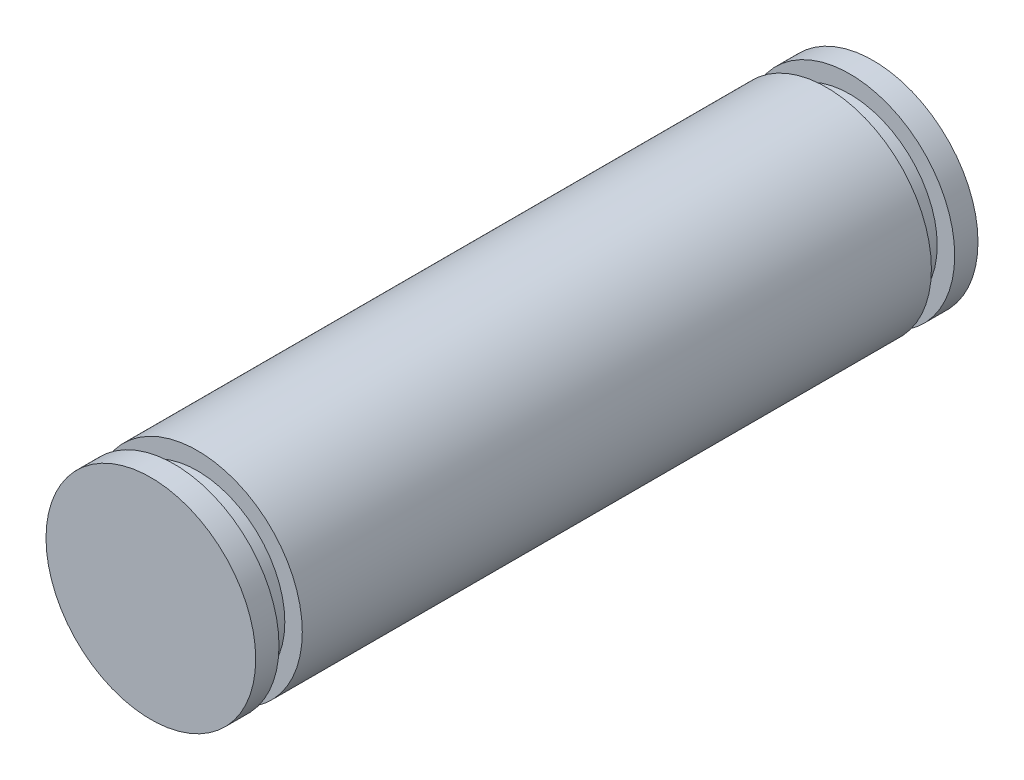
ISO-10303-21;
HEADER;
FILE_DESCRIPTION(('STEP AP214'),'2;1');
FILE_NAME('part.step','',(''),(''),'','','');
FILE_SCHEMA(('AUTOMOTIVE_DESIGN { 1 0 10303 214 1 1 1 1 }'));
ENDSEC;
DATA;
#1=APPLICATION_CONTEXT('core data for automotive mechanical design processes');
#2=APPLICATION_PROTOCOL_DEFINITION('international standard','automotive_design',2000,#1);
#3=PRODUCT_CONTEXT('',#1,'mechanical');
#4=PRODUCT('Part','Part','',(#3));
#5=PRODUCT_RELATED_PRODUCT_CATEGORY('part','',(#4));
#6=PRODUCT_DEFINITION_FORMATION('','',#4);
#7=PRODUCT_DEFINITION_CONTEXT('part definition',#1,'design');
#8=PRODUCT_DEFINITION('design','',#6,#7);
#9=PRODUCT_DEFINITION_SHAPE('','',#8);
#10=(LENGTH_UNIT() NAMED_UNIT(*) SI_UNIT(.MILLI.,.METRE.));
#11=(NAMED_UNIT(*) PLANE_ANGLE_UNIT() SI_UNIT($,.RADIAN.));
#12=(NAMED_UNIT(*) SI_UNIT($,.STERADIAN.) SOLID_ANGLE_UNIT());
#13=UNCERTAINTY_MEASURE_WITH_UNIT(LENGTH_MEASURE(1.E-05),#10,'distance_accuracy_value','');
#14=(GEOMETRIC_REPRESENTATION_CONTEXT(3) GLOBAL_UNCERTAINTY_ASSIGNED_CONTEXT((#13)) GLOBAL_UNIT_ASSIGNED_CONTEXT((#10,
#11,#12)) REPRESENTATION_CONTEXT('',''));
#15=CARTESIAN_POINT('',(0.,0.,0.));
#16=DIRECTION('',(0.,0.,1.));
#17=DIRECTION('',(1.,0.,0.));
#18=AXIS2_PLACEMENT_3D('',#15,#16,#17);
#19=CARTESIAN_POINT('',(0.,0.,29.));
#20=DIRECTION('',(0.,0.,1.));
#21=DIRECTION('',(1.,0.,0.));
#22=AXIS2_PLACEMENT_3D('',#19,#20,#21);
#23=PLANE('',#22);
#24=CARTESIAN_POINT('',(0.,0.,29.));
#25=DIRECTION('',(0.,0.,1.));
#26=DIRECTION('',(1.,0.,0.));
#27=AXIS2_PLACEMENT_3D('',#24,#25,#26);
#28=CIRCLE('',#27,4.5);
#29=CARTESIAN_POINT('',(4.5,0.,29.));
#30=VERTEX_POINT('',#29);
#31=EDGE_CURVE('E45',#30,#30,#28,.T.);
#32=ORIENTED_EDGE('',*,*,#31,.T.);
#33=EDGE_LOOP('',(#32));
#34=FACE_BOUND('',#33,.T.);
#35=CARTESIAN_POINT('',(0.,0.,29.));
#36=DIRECTION('',(0.,0.,1.));
#37=DIRECTION('',(1.,0.,0.));
#38=AXIS2_PLACEMENT_3D('',#35,#36,#37);
#39=CIRCLE('',#38,3.75);
#40=CARTESIAN_POINT('',(3.75,0.,29.));
#41=VERTEX_POINT('',#40);
#42=EDGE_CURVE('E54',#41,#41,#39,.T.);
#43=ORIENTED_EDGE('',*,*,#42,.F.);
#44=EDGE_LOOP('',(#43));
#45=FACE_BOUND('',#44,.T.);
#46=ADVANCED_FACE('F29',(#34,#45),#23,.T.);
#47=CARTESIAN_POINT('',(0.,0.,1.));
#48=DIRECTION('',(0.,0.,1.));
#49=DIRECTION('',(1.,0.,0.));
#50=AXIS2_PLACEMENT_3D('',#47,#48,#49);
#51=PLANE('',#50);
#52=CARTESIAN_POINT('',(0.,0.,1.));
#53=DIRECTION('',(0.,0.,1.));
#54=DIRECTION('',(1.,0.,0.));
#55=AXIS2_PLACEMENT_3D('',#52,#53,#54);
#56=CIRCLE('',#55,4.5);
#57=CARTESIAN_POINT('',(4.5,0.,1.));
#58=VERTEX_POINT('',#57);
#59=EDGE_CURVE('E10',#58,#58,#56,.T.);
#60=ORIENTED_EDGE('',*,*,#59,.T.);
#61=EDGE_LOOP('',(#60));
#62=FACE_BOUND('',#61,.T.);
#63=CARTESIAN_POINT('',(0.,0.,1.));
#64=DIRECTION('',(0.,0.,1.));
#65=DIRECTION('',(1.,0.,0.));
#66=AXIS2_PLACEMENT_3D('',#63,#64,#65);
#67=CIRCLE('',#66,3.75);
#68=CARTESIAN_POINT('',(3.75,0.,1.));
#69=VERTEX_POINT('',#68);
#70=EDGE_CURVE('E42',#69,#69,#67,.T.);
#71=ORIENTED_EDGE('',*,*,#70,.F.);
#72=EDGE_LOOP('',(#71));
#73=FACE_BOUND('',#72,.T.);
#74=ADVANCED_FACE('F88',(#62,#73),#51,.T.);
#75=CARTESIAN_POINT('',(0.,0.,1.));
#76=DIRECTION('',(0.,0.,-1.));
#77=DIRECTION('',(-1.,0.,0.));
#78=AXIS2_PLACEMENT_3D('',#75,#76,#77);
#79=CYLINDRICAL_SURFACE('',#78,4.5);
#80=ORIENTED_EDGE('',*,*,#59,.F.);
#81=EDGE_LOOP('',(#80));
#82=FACE_BOUND('',#81,.T.);
#83=CARTESIAN_POINT('',(0.,0.,0.));
#84=DIRECTION('',(0.,0.,1.));
#85=DIRECTION('',(1.,0.,0.));
#86=AXIS2_PLACEMENT_3D('',#83,#84,#85);
#87=CIRCLE('',#86,4.5);
#88=CARTESIAN_POINT('',(4.5,0.,0.));
#89=VERTEX_POINT('',#88);
#90=EDGE_CURVE('E33',#89,#89,#87,.T.);
#91=ORIENTED_EDGE('',*,*,#90,.T.);
#92=EDGE_LOOP('',(#91));
#93=FACE_BOUND('',#92,.T.);
#94=ADVANCED_FACE('F31',(#82,#93),#79,.T.);
#95=CARTESIAN_POINT('',(0.,0.,0.));
#96=DIRECTION('',(0.,0.,1.));
#97=DIRECTION('',(1.,0.,0.));
#98=AXIS2_PLACEMENT_3D('',#95,#96,#97);
#99=PLANE('',#98);
#100=ORIENTED_EDGE('',*,*,#90,.F.);
#101=EDGE_LOOP('',(#100));
#102=FACE_BOUND('',#101,.T.);
#103=ADVANCED_FACE('F105',(#102),#99,.F.);
#104=CARTESIAN_POINT('',(0.,0.,2.));
#105=DIRECTION('',(0.,0.,-1.));
#106=DIRECTION('',(-1.,0.,0.));
#107=AXIS2_PLACEMENT_3D('',#104,#105,#106);
#108=CYLINDRICAL_SURFACE('',#107,3.75);
#109=CARTESIAN_POINT('',(0.,0.,2.));
#110=DIRECTION('',(0.,0.,1.));
#111=DIRECTION('',(1.,0.,0.));
#112=AXIS2_PLACEMENT_3D('',#109,#110,#111);
#113=CIRCLE('',#112,3.75);
#114=CARTESIAN_POINT('',(3.75,0.,2.));
#115=VERTEX_POINT('',#114);
#116=EDGE_CURVE('E40',#115,#115,#113,.T.);
#117=ORIENTED_EDGE('',*,*,#116,.F.);
#118=EDGE_LOOP('',(#117));
#119=FACE_BOUND('',#118,.T.);
#120=ORIENTED_EDGE('',*,*,#70,.T.);
#121=EDGE_LOOP('',(#120));
#122=FACE_BOUND('',#121,.T.);
#123=ADVANCED_FACE('F99',(#119,#122),#108,.T.);
#124=CARTESIAN_POINT('',(0.,0.,2.));
#125=DIRECTION('',(0.,0.,1.));
#126=DIRECTION('',(1.,0.,0.));
#127=AXIS2_PLACEMENT_3D('',#124,#125,#126);
#128=PLANE('',#127);
#129=CARTESIAN_POINT('',(0.,0.,2.));
#130=DIRECTION('',(0.,0.,1.));
#131=DIRECTION('',(1.,0.,0.));
#132=AXIS2_PLACEMENT_3D('',#129,#130,#131);
#133=CIRCLE('',#132,4.5);
#134=CARTESIAN_POINT('',(4.5,0.,2.));
#135=VERTEX_POINT('',#134);
#136=EDGE_CURVE('E48',#135,#135,#133,.T.);
#137=ORIENTED_EDGE('',*,*,#136,.F.);
#138=EDGE_LOOP('',(#137));
#139=FACE_BOUND('',#138,.T.);
#140=ORIENTED_EDGE('',*,*,#116,.T.);
#141=EDGE_LOOP('',(#140));
#142=FACE_BOUND('',#141,.T.);
#143=ADVANCED_FACE('F96',(#139,#142),#128,.F.);
#144=CARTESIAN_POINT('',(0.,0.,29.));
#145=DIRECTION('',(0.,0.,-1.));
#146=DIRECTION('',(-1.,0.,0.));
#147=AXIS2_PLACEMENT_3D('',#144,#145,#146);
#148=CYLINDRICAL_SURFACE('',#147,4.5);
#149=ORIENTED_EDGE('',*,*,#31,.F.);
#150=EDGE_LOOP('',(#149));
#151=FACE_BOUND('',#150,.T.);
#152=ORIENTED_EDGE('',*,*,#136,.T.);
#153=EDGE_LOOP('',(#152));
#154=FACE_BOUND('',#153,.T.);
#155=ADVANCED_FACE('F83',(#151,#154),#148,.T.);
#156=CARTESIAN_POINT('',(0.,0.,30.));
#157=DIRECTION('',(0.,0.,-1.));
#158=DIRECTION('',(-1.,0.,0.));
#159=AXIS2_PLACEMENT_3D('',#156,#157,#158);
#160=CYLINDRICAL_SURFACE('',#159,3.75);
#161=CARTESIAN_POINT('',(0.,0.,30.));
#162=DIRECTION('',(0.,0.,1.));
#163=DIRECTION('',(1.,0.,0.));
#164=AXIS2_PLACEMENT_3D('',#161,#162,#163);
#165=CIRCLE('',#164,3.75);
#166=CARTESIAN_POINT('',(3.75,0.,30.));
#167=VERTEX_POINT('',#166);
#168=EDGE_CURVE('E51',#167,#167,#165,.T.);
#169=ORIENTED_EDGE('',*,*,#168,.F.);
#170=EDGE_LOOP('',(#169));
#171=FACE_BOUND('',#170,.T.);
#172=ORIENTED_EDGE('',*,*,#42,.T.);
#173=EDGE_LOOP('',(#172));
#174=FACE_BOUND('',#173,.T.);
#175=ADVANCED_FACE('F77',(#171,#174),#160,.T.);
#176=CARTESIAN_POINT('',(0.,0.,30.));
#177=DIRECTION('',(0.,0.,1.));
#178=DIRECTION('',(1.,0.,0.));
#179=AXIS2_PLACEMENT_3D('',#176,#177,#178);
#180=PLANE('',#179);
#181=CARTESIAN_POINT('',(0.,0.,30.));
#182=DIRECTION('',(0.,0.,1.));
#183=DIRECTION('',(1.,0.,0.));
#184=AXIS2_PLACEMENT_3D('',#181,#182,#183);
#185=CIRCLE('',#184,4.5);
#186=CARTESIAN_POINT('',(4.5,0.,30.));
#187=VERTEX_POINT('',#186);
#188=EDGE_CURVE('E60',#187,#187,#185,.T.);
#189=ORIENTED_EDGE('',*,*,#188,.F.);
#190=EDGE_LOOP('',(#189));
#191=FACE_BOUND('',#190,.T.);
#192=ORIENTED_EDGE('',*,*,#168,.T.);
#193=EDGE_LOOP('',(#192));
#194=FACE_BOUND('',#193,.T.);
#195=ADVANCED_FACE('F71',(#191,#194),#180,.F.);
#196=CARTESIAN_POINT('',(0.,0.,31.));
#197=DIRECTION('',(0.,0.,-1.));
#198=DIRECTION('',(-1.,0.,0.));
#199=AXIS2_PLACEMENT_3D('',#196,#197,#198);
#200=CYLINDRICAL_SURFACE('',#199,4.5);
#201=CARTESIAN_POINT('',(0.,0.,31.));
#202=DIRECTION('',(0.,0.,1.));
#203=DIRECTION('',(1.,0.,0.));
#204=AXIS2_PLACEMENT_3D('',#201,#202,#203);
#205=CIRCLE('',#204,4.5);
#206=CARTESIAN_POINT('',(4.5,0.,31.));
#207=VERTEX_POINT('',#206);
#208=EDGE_CURVE('E57',#207,#207,#205,.T.);
#209=ORIENTED_EDGE('',*,*,#208,.F.);
#210=EDGE_LOOP('',(#209));
#211=FACE_BOUND('',#210,.T.);
#212=ORIENTED_EDGE('',*,*,#188,.T.);
#213=EDGE_LOOP('',(#212));
#214=FACE_BOUND('',#213,.T.);
#215=ADVANCED_FACE('F68',(#211,#214),#200,.T.);
#216=CARTESIAN_POINT('',(0.,0.,31.));
#217=DIRECTION('',(0.,0.,1.));
#218=DIRECTION('',(1.,0.,0.));
#219=AXIS2_PLACEMENT_3D('',#216,#217,#218);
#220=PLANE('',#219);
#221=ORIENTED_EDGE('',*,*,#208,.T.);
#222=EDGE_LOOP('',(#221));
#223=FACE_BOUND('',#222,.T.);
#224=ADVANCED_FACE('F66',(#223),#220,.T.);
#225=CLOSED_SHELL('',(#46,#74,#94,#103,#123,#143,#155,#175,#195,#215,#224));
#226=MANIFOLD_SOLID_BREP('B2',#225);
#227=ADVANCED_BREP_SHAPE_REPRESENTATION('',(#18,#226),#14);
#228=SHAPE_DEFINITION_REPRESENTATION(#9,#227);
ENDSEC;
END-ISO-10303-21;
